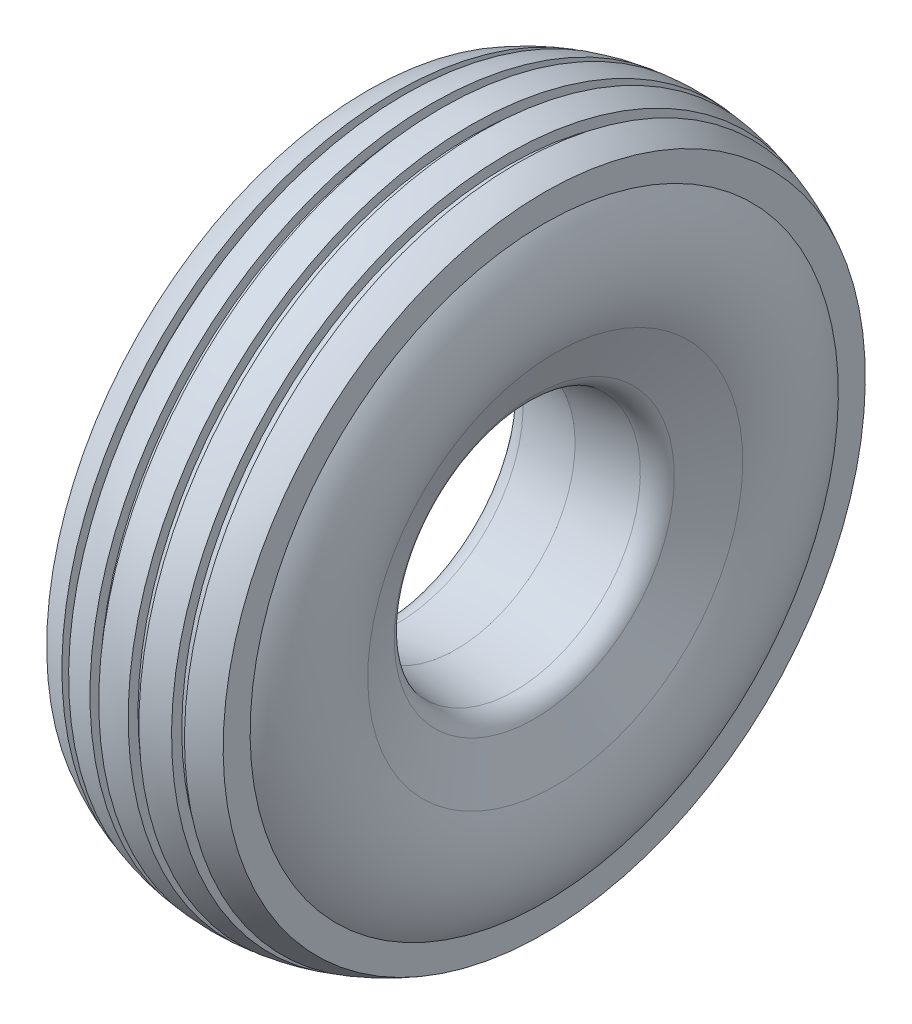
from build123d import *


with BuildPart() as part:
    # Esquisse14 → R_volution2 (revolve)
    with BuildSketch(Plane.XY):
        with BuildLine():
            Line((-18, 60), (-18, 65.5))
            ThreePointArc((-18, 65.5), (-15.297134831, 66.807954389), (-12.5, 67.899861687))
            Line((-12.5, 67.899861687), (-12.5, 65.776643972))
            ThreePointArc((-12.5, 65.776643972), (-11.50486896, 66.125870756), (-10.5, 66.446001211))
            Line((-10.5, 66.446001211), (-10.5, 68.530599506))
            ThreePointArc((-10.5, 68.530599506), (-7.77097687, 69.202295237), (-5, 69.671794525))
            Line((-5, 69.671794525), (-5, 67.653516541))
            ThreePointArc((-5, 67.653516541), (-4.001541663, 67.778463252), (-3, 67.875648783))
            Line((-3, 67.875648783), (-3, 69.882171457))
            ThreePointArc((-3, 69.882171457), (0, 70), (3, 69.882171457))
            Line((3, 69.882171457), (3, 67.875648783))
            ThreePointArc((3, 67.875648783), (4.001541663, 67.778463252), (5, 67.653516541))
            Line((5, 67.653516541), (5, 69.671794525))
            ThreePointArc((5, 69.671794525), (7.77097687, 69.202295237), (10.5, 68.530599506))
            Line((10.5, 68.530599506), (10.5, 66.446001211))
            ThreePointArc((10.5, 66.446001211), (11.50486896, 66.125870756), (12.5, 65.776643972))
            Line((12.5, 65.776643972), (12.5, 67.899861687))
            ThreePointArc((12.5, 67.899861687), (15.297134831, 66.807954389), (18, 65.5))
            Line((18, 65.5), (18, 60))
            ThreePointArc((18, 60), (22.025029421, 49.425003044), (20.25, 38.25))
            Line((20.25, 38.25), (15.95870881, 28.59209407))
            ThreePointArc((15.95870881, 28.59209407), (14.34624141, 26.590298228), (11.95232663, 25.654130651))
            Line((11.95232663, 25.654130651), (0, 24.3))
            Line((0, 24.3), (-11.95232663, 25.654130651))
            ThreePointArc((-11.95232663, 25.654130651), (-14.34624141, 26.590298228), (-15.95870881, 28.59209407))
            Line((-15.95870881, 28.59209407), (-20.25, 38.25))
            ThreePointArc((-20.25, 38.25), (-22.025029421, 49.425003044), (-18, 60))
        make_face()
        with BuildLine():
            Line((-12, 57.890460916), (-12, 59.518012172))
            ThreePointArc((-12, 59.518012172), (0, 62), (12, 59.518012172))
            Line((12, 59.518012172), (12, 57.890460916))
            ThreePointArc((12, 57.890460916), (15.939133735, 49.699406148), (14.766896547, 40.686303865))
            Line((14.766896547, 40.686303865), (10.70805532, 31.551545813))
            Line((10.70805532, 31.551545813), (0, 30.338384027))
            Line((0, 30.338384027), (-10.70805532, 31.551545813))
            Line((-10.70805532, 31.551545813), (-14.766896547, 40.686303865))
            ThreePointArc((-14.766896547, 40.686303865), (-15.939133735, 49.699406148), (-12, 57.890460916))
        make_face(mode=Mode.SUBTRACT)
    revolve(axis=Axis((14.65, 0, 0), (-1, 0, 0)))


solid = part.part
